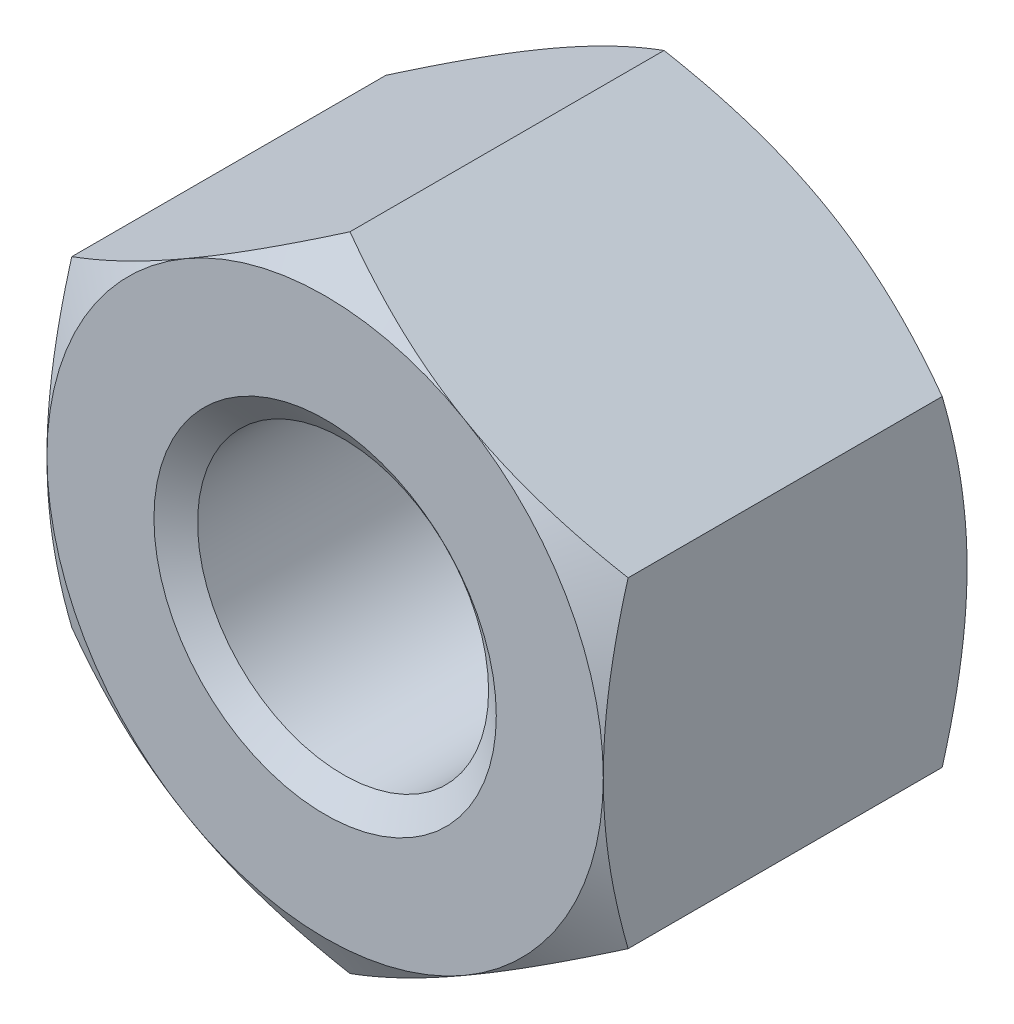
ISO-10303-21;
HEADER;
FILE_DESCRIPTION(('STEP AP214'),'2;1');
FILE_NAME('part.step','',(''),(''),'','','');
FILE_SCHEMA(('AUTOMOTIVE_DESIGN { 1 0 10303 214 1 1 1 1 }'));
ENDSEC;
DATA;
#1=APPLICATION_CONTEXT('core data for automotive mechanical design processes');
#2=APPLICATION_PROTOCOL_DEFINITION('international standard','automotive_design',2000,#1);
#3=PRODUCT_CONTEXT('',#1,'mechanical');
#4=PRODUCT('Part','Part','',(#3));
#5=PRODUCT_RELATED_PRODUCT_CATEGORY('part','',(#4));
#6=PRODUCT_DEFINITION_FORMATION('','',#4);
#7=PRODUCT_DEFINITION_CONTEXT('part definition',#1,'design');
#8=PRODUCT_DEFINITION('design','',#6,#7);
#9=PRODUCT_DEFINITION_SHAPE('','',#8);
#10=(LENGTH_UNIT() NAMED_UNIT(*) SI_UNIT(.MILLI.,.METRE.));
#11=(NAMED_UNIT(*) PLANE_ANGLE_UNIT() SI_UNIT($,.RADIAN.));
#12=(NAMED_UNIT(*) SI_UNIT($,.STERADIAN.) SOLID_ANGLE_UNIT());
#13=UNCERTAINTY_MEASURE_WITH_UNIT(LENGTH_MEASURE(1.E-05),#10,'distance_accuracy_value','');
#14=(GEOMETRIC_REPRESENTATION_CONTEXT(3) GLOBAL_UNCERTAINTY_ASSIGNED_CONTEXT((#13)) GLOBAL_UNIT_ASSIGNED_CONTEXT((#10,
#11,#12)) REPRESENTATION_CONTEXT('',''));
#15=CARTESIAN_POINT('',(0.,0.,0.));
#16=DIRECTION('',(0.,0.,1.));
#17=DIRECTION('',(1.,0.,0.));
#18=AXIS2_PLACEMENT_3D('',#15,#16,#17);
#19=CARTESIAN_POINT('',(0.,0.,-8.5));
#20=DIRECTION('',(0.,0.,1.));
#21=DIRECTION('',(1.,0.,0.));
#22=AXIS2_PLACEMENT_3D('',#19,#20,#21);
#23=CYLINDRICAL_SURFACE('',#22,3.4);
#24=CARTESIAN_POINT('',(0.,0.,-0.420124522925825));
#25=DIRECTION('',(0.,0.,1.));
#26=DIRECTION('',(1.,0.,0.));
#27=AXIS2_PLACEMENT_3D('',#24,#25,#26);
#28=CIRCLE('',#27,3.4);
#29=CARTESIAN_POINT('',(3.4,0.,-0.420124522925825));
#30=VERTEX_POINT('',#29);
#31=EDGE_CURVE('E183',#30,#30,#28,.F.);
#32=ORIENTED_EDGE('',*,*,#31,.F.);
#33=EDGE_LOOP('',(#32));
#34=FACE_BOUND('',#33,.T.);
#35=CARTESIAN_POINT('',(0.,0.,-8.05447547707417));
#36=DIRECTION('',(0.,0.,-1.));
#37=DIRECTION('',(-1.,0.,0.));
#38=AXIS2_PLACEMENT_3D('',#35,#36,#37);
#39=CIRCLE('',#38,3.4);
#40=CARTESIAN_POINT('',(-3.4,0.,-8.05447547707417));
#41=VERTEX_POINT('',#40);
#42=EDGE_CURVE('E48',#41,#41,#39,.F.);
#43=ORIENTED_EDGE('',*,*,#42,.F.);
#44=EDGE_LOOP('',(#43));
#45=FACE_BOUND('',#44,.T.);
#46=ADVANCED_FACE('F43',(#34,#45),#23,.F.);
#47=CARTESIAN_POINT('',(0.,7.50555349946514,-8.5));
#48=DIRECTION('',(-0.500000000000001,0.866025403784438,0.));
#49=DIRECTION('',(-0.866025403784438,-0.500000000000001,0.));
#50=AXIS2_PLACEMENT_3D('',#47,#48,#49);
#51=PLANE('',#50);
#52=DIRECTION('',(0.,0.,1.));
#53=VECTOR('',#52,1.);
#54=CARTESIAN_POINT('',(-6.5,3.75277674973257,-8.5));
#55=LINE('',#54,#53);
#56=CARTESIAN_POINT('',(-6.5,3.75277674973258,-7.91944341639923));
#57=VERTEX_POINT('',#56);
#58=CARTESIAN_POINT('',(-6.5,3.75277674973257,-0.580556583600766));
#59=VERTEX_POINT('',#58);
#60=EDGE_CURVE('E173',#57,#59,#55,.T.);
#61=ORIENTED_EDGE('',*,*,#60,.T.);
#62=CARTESIAN_POINT('',(-6.5002,3.75266127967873,-0.580623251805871));
#63=CARTESIAN_POINT('',(-6.35732254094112,3.8351516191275,-0.533004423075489));
#64=CARTESIAN_POINT('',(-6.21391236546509,3.91794952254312,-0.487546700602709));
#65=CARTESIAN_POINT('',(-5.9259273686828,4.08421773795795,-0.401548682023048));
#66=CARTESIAN_POINT('',(-5.78135207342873,4.16768832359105,-0.361010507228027));
#67=CARTESIAN_POINT('',(-5.34531134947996,4.41943655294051,-0.247571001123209));
#68=CARTESIAN_POINT('',(-5.05212471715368,4.5887079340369,-0.18304780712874));
#69=CARTESIAN_POINT('',(-4.61337625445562,4.84201947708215,-0.107386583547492));
#70=CARTESIAN_POINT('',(-4.46912536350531,4.92530276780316,-0.0858328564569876));
#71=CARTESIAN_POINT('',(-4.17997178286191,5.09224566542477,-0.049690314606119));
#72=CARTESIAN_POINT('',(-4.03506915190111,5.17590523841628,-0.0351008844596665));
#73=CARTESIAN_POINT('',(-3.74501222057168,5.34336968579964,-0.0132587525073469));
#74=CARTESIAN_POINT('',(-3.59985839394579,5.427174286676,-0.00599772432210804));
#75=CARTESIAN_POINT('',(-3.30942466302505,5.59485627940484,0.00103969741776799));
#76=CARTESIAN_POINT('',(-3.16414476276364,5.67873366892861,0.000816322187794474));
#77=CARTESIAN_POINT('',(-2.7661240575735,5.90853103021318,-0.0100834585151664));
#78=CARTESIAN_POINT('',(-2.51351353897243,6.05437578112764,-0.0283818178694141));
#79=CARTESIAN_POINT('',(-2.00997032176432,6.34509659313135,-0.0864063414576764));
#80=CARTESIAN_POINT('',(-1.75903939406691,6.48997163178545,-0.126152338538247));
#81=CARTESIAN_POINT('',(-1.25448277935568,6.78127752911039,-0.225505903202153));
#82=CARTESIAN_POINT('',(-1.00092075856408,6.92767163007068,-0.285534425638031));
#83=CARTESIAN_POINT('',(-0.497578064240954,7.21827667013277,-0.421774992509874));
#84=CARTESIAN_POINT('',(-0.247790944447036,7.36249133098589,-0.497955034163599));
#85=CARTESIAN_POINT('',(0.000200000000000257,7.50566896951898,-0.580623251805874));
#86=B_SPLINE_CURVE_WITH_KNOTS('',3,(#62,#63,#64,#65,#66,#67,#68,#69,#70,#71,#72,#73,#74,#75,#76,
#77,#78,#79,#80,#81,#82,#83,#84,#85),.UNSPECIFIED.,.F.,.F.,(4,2,2,2,2,2,2,2,2,2,2,4),(0.,
0.515105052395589,1.03043143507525,2.06322554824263,2.56697389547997,3.07067772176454,
3.57380860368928,4.07692394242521,4.95279354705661,5.82947446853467,6.72559912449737,
7.61996451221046),.UNSPECIFIED.);
#87=CARTESIAN_POINT('',(-3.25,5.62916512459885,0.));
#88=VERTEX_POINT('',#87);
#89=EDGE_CURVE('E142',#59,#88,#86,.T.);
#90=ORIENTED_EDGE('',*,*,#89,.T.);
#91=CARTESIAN_POINT('',(0.,7.50555349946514,-0.58055658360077));
#92=VERTEX_POINT('',#91);
#93=EDGE_CURVE('E62',#88,#92,#86,.T.);
#94=ORIENTED_EDGE('',*,*,#93,.T.);
#95=DIRECTION('',(0.,0.,1.));
#96=VECTOR('',#95,1.);
#97=CARTESIAN_POINT('',(0.,7.50555349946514,-8.5));
#98=LINE('',#97,#96);
#99=CARTESIAN_POINT('',(0.,7.50555349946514,-7.91944341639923));
#100=VERTEX_POINT('',#99);
#101=EDGE_CURVE('E158',#100,#92,#98,.T.);
#102=ORIENTED_EDGE('',*,*,#101,.F.);
#103=CARTESIAN_POINT('',(-6.5002,3.75266127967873,-7.91937674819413));
#104=CARTESIAN_POINT('',(-6.35732254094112,3.8351516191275,-7.96699557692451));
#105=CARTESIAN_POINT('',(-6.21391236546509,3.91794952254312,-8.01245329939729));
#106=CARTESIAN_POINT('',(-5.92592736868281,4.08421773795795,-8.09845131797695));
#107=CARTESIAN_POINT('',(-5.78135207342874,4.16768832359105,-8.13898949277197));
#108=CARTESIAN_POINT('',(-5.34531134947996,4.41943655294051,-8.25242899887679));
#109=CARTESIAN_POINT('',(-5.05212471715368,4.5887079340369,-8.31695219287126));
#110=CARTESIAN_POINT('',(-4.61337625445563,4.84201947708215,-8.39261341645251));
#111=CARTESIAN_POINT('',(-4.46912536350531,4.92530276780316,-8.41416714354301));
#112=CARTESIAN_POINT('',(-4.17997178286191,5.09224566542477,-8.45030968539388));
#113=CARTESIAN_POINT('',(-4.03506915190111,5.17590523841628,-8.46489911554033));
#114=CARTESIAN_POINT('',(-3.74501222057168,5.34336968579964,-8.48674124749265));
#115=CARTESIAN_POINT('',(-3.59985839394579,5.427174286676,-8.49400227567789));
#116=CARTESIAN_POINT('',(-3.30942466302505,5.59485627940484,-8.50103969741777));
#117=CARTESIAN_POINT('',(-3.16414476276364,5.67873366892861,-8.5008163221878));
#118=CARTESIAN_POINT('',(-2.7661240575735,5.90853103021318,-8.48991654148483));
#119=CARTESIAN_POINT('',(-2.51351353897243,6.05437578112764,-8.47161818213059));
#120=CARTESIAN_POINT('',(-2.00997032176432,6.34509659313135,-8.41359365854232));
#121=CARTESIAN_POINT('',(-1.75903939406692,6.48997163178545,-8.37384766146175));
#122=CARTESIAN_POINT('',(-1.25448277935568,6.78127752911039,-8.27449409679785));
#123=CARTESIAN_POINT('',(-1.00092075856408,6.92767163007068,-8.21446557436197));
#124=CARTESIAN_POINT('',(-0.497578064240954,7.21827667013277,-8.07822500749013));
#125=CARTESIAN_POINT('',(-0.247790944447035,7.36249133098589,-8.0020449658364));
#126=CARTESIAN_POINT('',(0.000200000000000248,7.50566896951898,-7.91937674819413));
#127=B_SPLINE_CURVE_WITH_KNOTS('',3,(#103,#104,#105,#106,#107,#108,#109,#110,#111,#112,#113,
#114,#115,#116,#117,#118,#119,#120,#121,#122,#123,#124,#125,#126),.UNSPECIFIED.,.F.,.F.,(4,2,2,
2,2,2,2,2,2,2,2,4),(0.,0.515105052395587,1.03043143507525,2.06322554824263,2.56697389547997,
3.07067772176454,3.57380860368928,4.07692394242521,4.9527935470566,5.82947446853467,
6.72559912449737,7.61996451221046),.UNSPECIFIED.);
#128=CARTESIAN_POINT('',(-3.25,5.62916512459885,-8.5));
#129=VERTEX_POINT('',#128);
#130=EDGE_CURVE('E176',#129,#100,#127,.T.);
#131=ORIENTED_EDGE('',*,*,#130,.F.);
#132=EDGE_CURVE('E275',#57,#129,#127,.T.);
#133=ORIENTED_EDGE('',*,*,#132,.F.);
#134=EDGE_LOOP('',(#61,#90,#94,#102,#131,#133));
#135=FACE_BOUND('',#134,.T.);
#136=ADVANCED_FACE('F45',(#135),#51,.T.);
#137=CARTESIAN_POINT('',(6.5,3.75277674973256,-8.5));
#138=DIRECTION('',(0.500000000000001,0.866025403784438,0.));
#139=DIRECTION('',(-0.866025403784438,0.500000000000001,0.));
#140=AXIS2_PLACEMENT_3D('',#137,#138,#139);
#141=PLANE('',#140);
#142=ORIENTED_EDGE('',*,*,#101,.T.);
#143=CARTESIAN_POINT('',(-0.000199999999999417,7.50566896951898,-0.580623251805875));
#144=CARTESIAN_POINT('',(0.142677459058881,7.4231786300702,-0.533004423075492));
#145=CARTESIAN_POINT('',(0.286087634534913,7.34038072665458,-0.487546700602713));
#146=CARTESIAN_POINT('',(0.574072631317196,7.17411251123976,-0.401548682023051));
#147=CARTESIAN_POINT('',(0.718647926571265,7.09064192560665,-0.36101050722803));
#148=CARTESIAN_POINT('',(1.15468865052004,6.83889369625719,-0.247571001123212));
#149=CARTESIAN_POINT('',(1.44787528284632,6.66962231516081,-0.183047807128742));
#150=CARTESIAN_POINT('',(1.88662374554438,6.41631077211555,-0.107386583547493));
#151=CARTESIAN_POINT('',(2.03087463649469,6.33302748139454,-0.0858328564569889));
#152=CARTESIAN_POINT('',(2.32002821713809,6.16608458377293,-0.0496903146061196));
#153=CARTESIAN_POINT('',(2.46493084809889,6.08242501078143,-0.0351008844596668));
#154=CARTESIAN_POINT('',(2.75498777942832,5.91496056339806,-0.0132587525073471));
#155=CARTESIAN_POINT('',(2.90014160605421,5.8311559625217,-0.00599772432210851));
#156=CARTESIAN_POINT('',(3.19057533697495,5.66347396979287,0.0010396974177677));
#157=CARTESIAN_POINT('',(3.33585523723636,5.5795965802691,0.000816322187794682));
#158=CARTESIAN_POINT('',(3.7338759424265,5.34979921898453,-0.0100834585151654));
#159=CARTESIAN_POINT('',(3.98648646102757,5.20395446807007,-0.0283818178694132));
#160=CARTESIAN_POINT('',(4.49002967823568,4.91323365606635,-0.0864063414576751));
#161=CARTESIAN_POINT('',(4.74096060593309,4.76835861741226,-0.126152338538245));
#162=CARTESIAN_POINT('',(5.24551722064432,4.47705272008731,-0.225505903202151));
#163=CARTESIAN_POINT('',(5.49907924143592,4.33065861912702,-0.285534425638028));
#164=CARTESIAN_POINT('',(6.00242193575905,4.04005357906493,-0.421774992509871));
#165=CARTESIAN_POINT('',(6.25220905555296,3.89583891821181,-0.497955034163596));
#166=CARTESIAN_POINT('',(6.5002,3.75266127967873,-0.58062325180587));
#167=B_SPLINE_CURVE_WITH_KNOTS('',3,(#143,#144,#145,#146,#147,#148,#149,#150,#151,#152,#153,
#154,#155,#156,#157,#158,#159,#160,#161,#162,#163,#164,#165,#166),.UNSPECIFIED.,.F.,.F.,(4,2,2,
2,2,2,2,2,2,2,2,4),(0.,0.515105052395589,1.03043143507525,2.06322554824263,2.56697389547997,
3.07067772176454,3.57380860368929,4.07692394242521,4.95279354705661,5.82947446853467,
6.72559912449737,7.61996451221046),.UNSPECIFIED.);
#168=CARTESIAN_POINT('',(3.25000000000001,5.62916512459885,0.));
#169=VERTEX_POINT('',#168);
#170=EDGE_CURVE('E152',#92,#169,#167,.T.);
#171=ORIENTED_EDGE('',*,*,#170,.T.);
#172=CARTESIAN_POINT('',(6.5,3.75277674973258,-0.58055658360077));
#173=VERTEX_POINT('',#172);
#174=EDGE_CURVE('E69',#169,#173,#167,.T.);
#175=ORIENTED_EDGE('',*,*,#174,.T.);
#176=DIRECTION('',(0.,0.,1.));
#177=VECTOR('',#176,1.);
#178=CARTESIAN_POINT('',(6.5,3.75277674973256,-8.5));
#179=LINE('',#178,#177);
#180=CARTESIAN_POINT('',(6.5,3.75277674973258,-7.91944341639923));
#181=VERTEX_POINT('',#180);
#182=EDGE_CURVE('E151',#181,#173,#179,.T.);
#183=ORIENTED_EDGE('',*,*,#182,.F.);
#184=CARTESIAN_POINT('',(-0.000199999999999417,7.50566896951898,-7.91937674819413));
#185=CARTESIAN_POINT('',(0.142677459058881,7.4231786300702,-7.96699557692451));
#186=CARTESIAN_POINT('',(0.286087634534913,7.34038072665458,-8.01245329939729));
#187=CARTESIAN_POINT('',(0.574072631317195,7.17411251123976,-8.09845131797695));
#188=CARTESIAN_POINT('',(0.718647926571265,7.09064192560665,-8.13898949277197));
#189=CARTESIAN_POINT('',(1.15468865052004,6.83889369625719,-8.25242899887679));
#190=CARTESIAN_POINT('',(1.44787528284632,6.66962231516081,-8.31695219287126));
#191=CARTESIAN_POINT('',(1.88662374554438,6.41631077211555,-8.39261341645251));
#192=CARTESIAN_POINT('',(2.03087463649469,6.33302748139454,-8.41416714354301));
#193=CARTESIAN_POINT('',(2.32002821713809,6.16608458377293,-8.45030968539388));
#194=CARTESIAN_POINT('',(2.46493084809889,6.08242501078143,-8.46489911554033));
#195=CARTESIAN_POINT('',(2.75498777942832,5.91496056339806,-8.48674124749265));
#196=CARTESIAN_POINT('',(2.90014160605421,5.8311559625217,-8.49400227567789));
#197=CARTESIAN_POINT('',(3.19057533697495,5.66347396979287,-8.50103969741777));
#198=CARTESIAN_POINT('',(3.33585523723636,5.5795965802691,-8.5008163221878));
#199=CARTESIAN_POINT('',(3.7338759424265,5.34979921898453,-8.48991654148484));
#200=CARTESIAN_POINT('',(3.98648646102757,5.20395446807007,-8.47161818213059));
#201=CARTESIAN_POINT('',(4.49002967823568,4.91323365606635,-8.41359365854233));
#202=CARTESIAN_POINT('',(4.74096060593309,4.76835861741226,-8.37384766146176));
#203=CARTESIAN_POINT('',(5.24551722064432,4.47705272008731,-8.27449409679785));
#204=CARTESIAN_POINT('',(5.49907924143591,4.33065861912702,-8.21446557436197));
#205=CARTESIAN_POINT('',(6.00242193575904,4.04005357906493,-8.07822500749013));
#206=CARTESIAN_POINT('',(6.25220905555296,3.89583891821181,-8.00204496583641));
#207=CARTESIAN_POINT('',(6.5002,3.75266127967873,-7.91937674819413));
#208=B_SPLINE_CURVE_WITH_KNOTS('',3,(#184,#185,#186,#187,#188,#189,#190,#191,#192,#193,#194,
#195,#196,#197,#198,#199,#200,#201,#202,#203,#204,#205,#206,#207),.UNSPECIFIED.,.F.,.F.,(4,2,2,
2,2,2,2,2,2,2,2,4),(0.,0.515105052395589,1.03043143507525,2.06322554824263,2.56697389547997,
3.07067772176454,3.57380860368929,4.07692394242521,4.95279354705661,5.82947446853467,
6.72559912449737,7.61996451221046),.UNSPECIFIED.);
#209=CARTESIAN_POINT('',(3.25000000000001,5.62916512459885,-8.5));
#210=VERTEX_POINT('',#209);
#211=EDGE_CURVE('E268',#210,#181,#208,.T.);
#212=ORIENTED_EDGE('',*,*,#211,.F.);
#213=EDGE_CURVE('E274',#100,#210,#208,.T.);
#214=ORIENTED_EDGE('',*,*,#213,.F.);
#215=EDGE_LOOP('',(#142,#171,#175,#183,#212,#214));
#216=FACE_BOUND('',#215,.T.);
#217=ADVANCED_FACE('F149',(#216),#141,.T.);
#218=CARTESIAN_POINT('',(6.5,3.75277674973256,-8.5));
#219=DIRECTION('',(-1.,0.,0.));
#220=DIRECTION('',(0.,0.,1.));
#221=AXIS2_PLACEMENT_3D('',#218,#219,#220);
#222=PLANE('',#221);
#223=CARTESIAN_POINT('',(6.5,-9.95291698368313,-3.11042358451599));
#224=CARTESIAN_POINT('',(6.5,-9.66753022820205,-2.97250893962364));
#225=CARTESIAN_POINT('',(6.5,-9.38146872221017,-2.8359652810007));
#226=CARTESIAN_POINT('',(6.5,-8.80763137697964,-2.56640336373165));
#227=CARTESIAN_POINT('',(6.5,-8.51985525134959,-2.43338571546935));
#228=CARTESIAN_POINT('',(6.5,-7.94066929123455,-2.17095850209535));
#229=CARTESIAN_POINT('',(6.5,-7.64924808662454,-2.04157394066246));
#230=CARTESIAN_POINT('',(6.5,-7.06401043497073,-1.78836220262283));
#231=CARTESIAN_POINT('',(6.5,-6.77019411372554,-1.66453473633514));
#232=CARTESIAN_POINT('',(6.5,-6.17605150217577,-1.42244480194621));
#233=CARTESIAN_POINT('',(6.5,-5.87568957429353,-1.30426931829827));
#234=CARTESIAN_POINT('',(6.5,-5.27142269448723,-1.07717389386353));
#235=CARTESIAN_POINT('',(6.5,-4.96751735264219,-0.968254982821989));
#236=CARTESIAN_POINT('',(6.5,-4.35630541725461,-0.762599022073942));
#237=CARTESIAN_POINT('',(6.5,-4.04900762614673,-0.665836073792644));
#238=CARTESIAN_POINT('',(6.5,-3.43004022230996,-0.487635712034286));
#239=CARTESIAN_POINT('',(6.5,-3.11837202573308,-0.406193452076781));
#240=CARTESIAN_POINT('',(6.5,-2.49046594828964,-0.262584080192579));
#241=CARTESIAN_POINT('',(6.5,-2.17422687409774,-0.200422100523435));
#242=CARTESIAN_POINT('',(6.5,-1.5378916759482,-0.0995742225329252));
#243=CARTESIAN_POINT('',(6.5,-1.2177955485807,-0.0608883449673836));
#244=CARTESIAN_POINT('',(6.5,-0.737141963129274,-0.0229465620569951));
#245=CARTESIAN_POINT('',(6.5,-0.577336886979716,-0.0136452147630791));
#246=CARTESIAN_POINT('',(6.5,-0.25746890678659,-0.00181408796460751));
#247=CARTESIAN_POINT('',(6.5,-0.0974060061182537,0.000715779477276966));
#248=CARTESIAN_POINT('',(6.5,0.222635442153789,-0.00106401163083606));
#249=CARTESIAN_POINT('',(6.5,0.382614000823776,-0.0053717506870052));
#250=CARTESIAN_POINT('',(6.5,0.702250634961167,-0.020717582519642));
#251=CARTESIAN_POINT('',(6.5,0.861908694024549,-0.0317560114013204));
#252=CARTESIAN_POINT('',(6.5,1.24887053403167,-0.0664368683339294));
#253=CARTESIAN_POINT('',(6.5,1.47587694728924,-0.0934518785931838));
#254=CARTESIAN_POINT('',(6.5,1.92815030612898,-0.159589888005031));
#255=CARTESIAN_POINT('',(6.5,2.15341675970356,-0.198716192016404));
#256=CARTESIAN_POINT('',(6.5,2.60202427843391,-0.2876891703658));
#257=CARTESIAN_POINT('',(6.5,2.82536331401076,-0.337545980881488));
#258=CARTESIAN_POINT('',(6.5,3.26974354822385,-0.446458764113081));
#259=CARTESIAN_POINT('',(6.5,3.49078496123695,-0.505513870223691));
#260=CARTESIAN_POINT('',(6.5,3.93601414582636,-0.632954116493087));
#261=CARTESIAN_POINT('',(6.5,4.16014622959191,-0.701532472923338));
#262=CARTESIAN_POINT('',(6.5,4.60604131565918,-0.8454651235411));
#263=CARTESIAN_POINT('',(6.5,4.82780583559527,-0.920814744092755));
#264=CARTESIAN_POINT('',(6.5,5.26807593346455,-1.07673350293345));
#265=CARTESIAN_POINT('',(6.5,5.48659282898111,-1.15727087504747));
#266=CARTESIAN_POINT('',(6.5,5.9219312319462,-1.32307270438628));
#267=CARTESIAN_POINT('',(6.5,6.13875201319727,-1.40833907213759));
#268=CARTESIAN_POINT('',(6.5,6.35478510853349,-1.49550213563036));
#269=B_SPLINE_CURVE_WITH_KNOTS('',3,(#223,#224,#225,#226,#227,#228,#229,#230,#231,#232,#233,
#234,#235,#236,#237,#238,#239,#240,#241,#242,#243,#244,#245,#246,#247,#248,#249,#250,#251,#252,
#253,#254,#255,#256,#257,#258,#259,#260,#261,#262,#263,#264,#265,#266,#267,#268),.UNSPECIFIED.,
.F.,.F.,(4,2,2,2,2,2,2,2,2,2,2,2,2,2,2,2,2,2,2,2,2,2,4),(0.,0.95090416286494,1.90197187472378,
2.85848216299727,3.81494253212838,4.78314526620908,5.75145556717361,6.71766655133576,
7.68357137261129,8.64973308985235,9.61589566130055,10.0960003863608,10.5760988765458,
11.0560626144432,11.5360503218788,12.2214931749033,12.9071232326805,13.5934038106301,
14.2796197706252,14.9826563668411,15.6852113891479,16.3838119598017,17.082696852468),.UNSPECIFIED.);
#270=CARTESIAN_POINT('',(6.5,-3.75277674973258,-0.58055658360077));
#271=VERTEX_POINT('',#270);
#272=CARTESIAN_POINT('',(6.5,0.,0.));
#273=VERTEX_POINT('',#272);
#274=EDGE_CURVE('E144',#271,#273,#269,.T.);
#275=ORIENTED_EDGE('',*,*,#274,.F.);
#276=DIRECTION('',(0.,0.,1.));
#277=VECTOR('',#276,1.);
#278=CARTESIAN_POINT('',(6.5,-3.75277674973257,-8.5));
#279=LINE('',#278,#277);
#280=CARTESIAN_POINT('',(6.5,-3.75277674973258,-7.91944341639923));
#281=VERTEX_POINT('',#280);
#282=EDGE_CURVE('E159',#281,#271,#279,.T.);
#283=ORIENTED_EDGE('',*,*,#282,.F.);
#284=CARTESIAN_POINT('',(6.5,-9.95291698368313,-5.38957641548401));
#285=CARTESIAN_POINT('',(6.5,-9.66753022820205,-5.52749106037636));
#286=CARTESIAN_POINT('',(6.5,-9.38146872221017,-5.6640347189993));
#287=CARTESIAN_POINT('',(6.5,-8.80763137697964,-5.93359663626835));
#288=CARTESIAN_POINT('',(6.5,-8.51985525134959,-6.06661428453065));
#289=CARTESIAN_POINT('',(6.5,-7.94066929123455,-6.32904149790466));
#290=CARTESIAN_POINT('',(6.5,-7.64924808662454,-6.45842605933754));
#291=CARTESIAN_POINT('',(6.5,-7.06401043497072,-6.71163779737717));
#292=CARTESIAN_POINT('',(6.5,-6.77019411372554,-6.83546526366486));
#293=CARTESIAN_POINT('',(6.5,-6.17605150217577,-7.07755519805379));
#294=CARTESIAN_POINT('',(6.5,-5.87568957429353,-7.19573068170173));
#295=CARTESIAN_POINT('',(6.5,-5.27142269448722,-7.42282610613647));
#296=CARTESIAN_POINT('',(6.5,-4.96751735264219,-7.53174501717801));
#297=CARTESIAN_POINT('',(6.5,-4.35630541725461,-7.73740097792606));
#298=CARTESIAN_POINT('',(6.5,-4.04900762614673,-7.83416392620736));
#299=CARTESIAN_POINT('',(6.5,-3.43004022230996,-8.01236428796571));
#300=CARTESIAN_POINT('',(6.5,-3.11837202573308,-8.09380654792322));
#301=CARTESIAN_POINT('',(6.5,-2.49046594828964,-8.23741591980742));
#302=CARTESIAN_POINT('',(6.5,-2.17422687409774,-8.29957789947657));
#303=CARTESIAN_POINT('',(6.5,-1.5378916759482,-8.40042577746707));
#304=CARTESIAN_POINT('',(6.5,-1.21779554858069,-8.43911165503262));
#305=CARTESIAN_POINT('',(6.5,-0.737141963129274,-8.477053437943));
#306=CARTESIAN_POINT('',(6.5,-0.577336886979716,-8.48635478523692));
#307=CARTESIAN_POINT('',(6.5,-0.257468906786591,-8.49818591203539));
#308=CARTESIAN_POINT('',(6.5,-0.0974060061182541,-8.50071577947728));
#309=CARTESIAN_POINT('',(6.5,0.222635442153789,-8.49893598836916));
#310=CARTESIAN_POINT('',(6.5,0.382614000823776,-8.494628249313));
#311=CARTESIAN_POINT('',(6.5,0.702250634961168,-8.47928241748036));
#312=CARTESIAN_POINT('',(6.5,0.861908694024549,-8.46824398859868));
#313=CARTESIAN_POINT('',(6.5,1.24887053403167,-8.43356313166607));
#314=CARTESIAN_POINT('',(6.5,1.47587694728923,-8.40654812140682));
#315=CARTESIAN_POINT('',(6.5,1.92815030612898,-8.34041011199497));
#316=CARTESIAN_POINT('',(6.5,2.15341675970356,-8.3012838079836));
#317=CARTESIAN_POINT('',(6.5,2.6020242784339,-8.2123108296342));
#318=CARTESIAN_POINT('',(6.5,2.82536331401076,-8.16245401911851));
#319=CARTESIAN_POINT('',(6.5,3.26974354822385,-8.05354123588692));
#320=CARTESIAN_POINT('',(6.5,3.49078496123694,-7.99448612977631));
#321=CARTESIAN_POINT('',(6.5,3.93601414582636,-7.86704588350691));
#322=CARTESIAN_POINT('',(6.5,4.16014622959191,-7.79846752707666));
#323=CARTESIAN_POINT('',(6.5,4.60604131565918,-7.6545348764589));
#324=CARTESIAN_POINT('',(6.5,4.82780583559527,-7.57918525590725));
#325=CARTESIAN_POINT('',(6.5,5.26807593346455,-7.42326649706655));
#326=CARTESIAN_POINT('',(6.5,5.48659282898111,-7.34272912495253));
#327=CARTESIAN_POINT('',(6.5,5.9219312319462,-7.17692729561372));
#328=CARTESIAN_POINT('',(6.5,6.13875201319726,-7.09166092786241));
#329=CARTESIAN_POINT('',(6.5,6.35478510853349,-7.00449786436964));
#330=B_SPLINE_CURVE_WITH_KNOTS('',3,(#284,#285,#286,#287,#288,#289,#290,#291,#292,#293,#294,
#295,#296,#297,#298,#299,#300,#301,#302,#303,#304,#305,#306,#307,#308,#309,#310,#311,#312,#313,
#314,#315,#316,#317,#318,#319,#320,#321,#322,#323,#324,#325,#326,#327,#328,#329),.UNSPECIFIED.,
.F.,.F.,(4,2,2,2,2,2,2,2,2,2,2,2,2,2,2,2,2,2,2,2,2,2,4),(0.,0.95090416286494,1.90197187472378,
2.85848216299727,3.81494253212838,4.78314526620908,5.75145556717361,6.71766655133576,
7.68357137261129,8.64973308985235,9.61589566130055,10.0960003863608,10.5760988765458,
11.0560626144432,11.5360503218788,12.2214931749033,12.9071232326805,13.5934038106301,
14.2796197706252,14.9826563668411,15.6852113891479,16.3838119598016,17.082696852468),.UNSPECIFIED.);
#331=CARTESIAN_POINT('',(6.5,0.,-8.5));
#332=VERTEX_POINT('',#331);
#333=EDGE_CURVE('E282',#281,#332,#330,.T.);
#334=ORIENTED_EDGE('',*,*,#333,.T.);
#335=EDGE_CURVE('E157',#332,#181,#330,.T.);
#336=ORIENTED_EDGE('',*,*,#335,.T.);
#337=ORIENTED_EDGE('',*,*,#182,.T.);
#338=EDGE_CURVE('E134',#273,#173,#269,.T.);
#339=ORIENTED_EDGE('',*,*,#338,.F.);
#340=EDGE_LOOP('',(#275,#283,#334,#336,#337,#339));
#341=FACE_BOUND('',#340,.T.);
#342=ADVANCED_FACE('F155',(#341),#222,.F.);
#343=CARTESIAN_POINT('',(0.,-7.50555349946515,-8.5));
#344=DIRECTION('',(0.5,-0.866025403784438,0.));
#345=DIRECTION('',(0.866025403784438,0.5,0.));
#346=AXIS2_PLACEMENT_3D('',#343,#344,#345);
#347=PLANE('',#346);
#348=ORIENTED_EDGE('',*,*,#282,.T.);
#349=CARTESIAN_POINT('',(6.5002,-3.75266127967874,-0.580623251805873));
#350=CARTESIAN_POINT('',(6.35732254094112,-3.83515161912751,-0.533004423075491));
#351=CARTESIAN_POINT('',(6.21391236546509,-3.91794952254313,-0.487546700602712));
#352=CARTESIAN_POINT('',(5.9259273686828,-4.08421773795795,-0.401548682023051));
#353=CARTESIAN_POINT('',(5.78135207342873,-4.16768832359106,-0.36101050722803));
#354=CARTESIAN_POINT('',(5.34531134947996,-4.41943655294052,-0.247571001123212));
#355=CARTESIAN_POINT('',(5.05212471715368,-4.58870793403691,-0.183047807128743));
#356=CARTESIAN_POINT('',(4.61337625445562,-4.84201947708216,-0.107386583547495));
#357=CARTESIAN_POINT('',(4.46912536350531,-4.92530276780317,-0.0858328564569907));
#358=CARTESIAN_POINT('',(4.17997178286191,-5.09224566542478,-0.0496903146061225));
#359=CARTESIAN_POINT('',(4.03506915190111,-5.17590523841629,-0.0351008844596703));
#360=CARTESIAN_POINT('',(3.74501222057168,-5.34336968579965,-0.0132587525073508));
#361=CARTESIAN_POINT('',(3.59985839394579,-5.42717428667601,-0.00599772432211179));
#362=CARTESIAN_POINT('',(3.30942466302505,-5.59485627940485,0.00103969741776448));
#363=CARTESIAN_POINT('',(3.16414476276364,-5.67873366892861,0.000816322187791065));
#364=CARTESIAN_POINT('',(2.7661240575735,-5.90853103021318,-0.0100834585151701));
#365=CARTESIAN_POINT('',(2.51351353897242,-6.05437578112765,-0.0283818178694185));
#366=CARTESIAN_POINT('',(2.00997032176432,-6.34509659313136,-0.0864063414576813));
#367=CARTESIAN_POINT('',(1.75903939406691,-6.48997163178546,-0.126152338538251));
#368=CARTESIAN_POINT('',(1.25448277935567,-6.7812775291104,-0.225505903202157));
#369=CARTESIAN_POINT('',(1.00092075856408,-6.92767163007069,-0.285534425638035));
#370=CARTESIAN_POINT('',(0.497578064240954,-7.21827667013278,-0.421774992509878));
#371=CARTESIAN_POINT('',(0.247790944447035,-7.3624913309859,-0.497955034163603));
#372=CARTESIAN_POINT('',(-0.000200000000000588,-7.50566896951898,-0.580623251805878));
#373=B_SPLINE_CURVE_WITH_KNOTS('',3,(#349,#350,#351,#352,#353,#354,#355,#356,#357,#358,#359,
#360,#361,#362,#363,#364,#365,#366,#367,#368,#369,#370,#371,#372),.UNSPECIFIED.,.F.,.F.,(4,2,2,
2,2,2,2,2,2,2,2,4),(0.,0.515105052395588,1.03043143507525,2.06322554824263,2.56697389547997,
3.07067772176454,3.57380860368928,4.07692394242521,4.95279354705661,5.82947446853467,
6.72559912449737,7.61996451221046),.UNSPECIFIED.);
#374=CARTESIAN_POINT('',(3.25,-5.62916512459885,0.));
#375=VERTEX_POINT('',#374);
#376=EDGE_CURVE('E380',#271,#375,#373,.T.);
#377=ORIENTED_EDGE('',*,*,#376,.T.);
#378=CARTESIAN_POINT('',(0.,-7.50555349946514,-0.58055658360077));
#379=VERTEX_POINT('',#378);
#380=EDGE_CURVE('E236',#375,#379,#373,.T.);
#381=ORIENTED_EDGE('',*,*,#380,.T.);
#382=DIRECTION('',(0.,0.,1.));
#383=VECTOR('',#382,1.);
#384=CARTESIAN_POINT('',(0.,-7.50555349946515,-8.5));
#385=LINE('',#384,#383);
#386=CARTESIAN_POINT('',(0.,-7.50555349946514,-7.91944341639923));
#387=VERTEX_POINT('',#386);
#388=EDGE_CURVE('E164',#387,#379,#385,.T.);
#389=ORIENTED_EDGE('',*,*,#388,.F.);
#390=CARTESIAN_POINT('',(6.5002,-3.75266127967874,-7.91937674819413));
#391=CARTESIAN_POINT('',(6.35732254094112,-3.83515161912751,-7.96699557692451));
#392=CARTESIAN_POINT('',(6.21391236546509,-3.91794952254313,-8.01245329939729));
#393=CARTESIAN_POINT('',(5.9259273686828,-4.08421773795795,-8.09845131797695));
#394=CARTESIAN_POINT('',(5.78135207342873,-4.16768832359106,-8.13898949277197));
#395=CARTESIAN_POINT('',(5.34531134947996,-4.41943655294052,-8.25242899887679));
#396=CARTESIAN_POINT('',(5.05212471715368,-4.58870793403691,-8.31695219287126));
#397=CARTESIAN_POINT('',(4.61337625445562,-4.84201947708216,-8.39261341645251));
#398=CARTESIAN_POINT('',(4.46912536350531,-4.92530276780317,-8.41416714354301));
#399=CARTESIAN_POINT('',(4.17997178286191,-5.09224566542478,-8.45030968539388));
#400=CARTESIAN_POINT('',(4.03506915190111,-5.17590523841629,-8.46489911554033));
#401=CARTESIAN_POINT('',(3.74501222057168,-5.34336968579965,-8.48674124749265));
#402=CARTESIAN_POINT('',(3.59985839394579,-5.42717428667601,-8.49400227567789));
#403=CARTESIAN_POINT('',(3.30942466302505,-5.59485627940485,-8.50103969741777));
#404=CARTESIAN_POINT('',(3.16414476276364,-5.67873366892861,-8.50081632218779));
#405=CARTESIAN_POINT('',(2.7661240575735,-5.90853103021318,-8.48991654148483));
#406=CARTESIAN_POINT('',(2.51351353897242,-6.05437578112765,-8.47161818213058));
#407=CARTESIAN_POINT('',(2.00997032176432,-6.34509659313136,-8.41359365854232));
#408=CARTESIAN_POINT('',(1.75903939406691,-6.48997163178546,-8.37384766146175));
#409=CARTESIAN_POINT('',(1.25448277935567,-6.7812775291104,-8.27449409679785));
#410=CARTESIAN_POINT('',(1.00092075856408,-6.92767163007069,-8.21446557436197));
#411=CARTESIAN_POINT('',(0.497578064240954,-7.21827667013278,-8.07822500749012));
#412=CARTESIAN_POINT('',(0.247790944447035,-7.3624913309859,-8.0020449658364));
#413=CARTESIAN_POINT('',(-0.000200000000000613,-7.50566896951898,-7.91937674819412));
#414=B_SPLINE_CURVE_WITH_KNOTS('',3,(#390,#391,#392,#393,#394,#395,#396,#397,#398,#399,#400,
#401,#402,#403,#404,#405,#406,#407,#408,#409,#410,#411,#412,#413),.UNSPECIFIED.,.F.,.F.,(4,2,2,
2,2,2,2,2,2,2,2,4),(0.,0.515105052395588,1.03043143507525,2.06322554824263,2.56697389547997,
3.07067772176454,3.57380860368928,4.07692394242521,4.95279354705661,5.82947446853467,
6.72559912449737,7.61996451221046),.UNSPECIFIED.);
#415=CARTESIAN_POINT('',(3.25,-5.62916512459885,-8.5));
#416=VERTEX_POINT('',#415);
#417=EDGE_CURVE('E289',#416,#387,#414,.T.);
#418=ORIENTED_EDGE('',*,*,#417,.F.);
#419=EDGE_CURVE('E288',#281,#416,#414,.T.);
#420=ORIENTED_EDGE('',*,*,#419,.F.);
#421=EDGE_LOOP('',(#348,#377,#381,#389,#418,#420));
#422=FACE_BOUND('',#421,.T.);
#423=ADVANCED_FACE('F301',(#422),#347,.T.);
#424=CARTESIAN_POINT('',(-6.5,-3.75277674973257,-8.5));
#425=DIRECTION('',(-0.500000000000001,-0.866025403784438,0.));
#426=DIRECTION('',(0.866025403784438,-0.500000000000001,0.));
#427=AXIS2_PLACEMENT_3D('',#424,#425,#426);
#428=PLANE('',#427);
#429=ORIENTED_EDGE('',*,*,#388,.T.);
#430=CARTESIAN_POINT('',(0.000199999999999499,-7.50566896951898,-0.580623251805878));
#431=CARTESIAN_POINT('',(-0.142677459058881,-7.42317863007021,-0.533004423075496));
#432=CARTESIAN_POINT('',(-0.286087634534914,-7.34038072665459,-0.487546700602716));
#433=CARTESIAN_POINT('',(-0.574072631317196,-7.17411251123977,-0.401548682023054));
#434=CARTESIAN_POINT('',(-0.718647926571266,-7.09064192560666,-0.361010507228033));
#435=CARTESIAN_POINT('',(-1.15468865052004,-6.8388936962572,-0.247571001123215));
#436=CARTESIAN_POINT('',(-1.44787528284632,-6.66962231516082,-0.183047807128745));
#437=CARTESIAN_POINT('',(-1.88662374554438,-6.41631077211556,-0.107386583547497));
#438=CARTESIAN_POINT('',(-2.0308746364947,-6.33302748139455,-0.0858328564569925));
#439=CARTESIAN_POINT('',(-2.32002821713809,-6.16608458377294,-0.0496903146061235));
#440=CARTESIAN_POINT('',(-2.46493084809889,-6.08242501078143,-0.0351008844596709));
#441=CARTESIAN_POINT('',(-2.75498777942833,-5.91496056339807,-0.0132587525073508));
#442=CARTESIAN_POINT('',(-2.90014160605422,-5.83115596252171,-0.00599772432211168));
#443=CARTESIAN_POINT('',(-3.19057533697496,-5.66347396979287,0.00103969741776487));
#444=CARTESIAN_POINT('',(-3.33585523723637,-5.5795965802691,0.000816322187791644));
#445=CARTESIAN_POINT('',(-3.7338759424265,-5.34979921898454,-0.010083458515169));
#446=CARTESIAN_POINT('',(-3.98648646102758,-5.20395446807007,-0.0283818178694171));
#447=CARTESIAN_POINT('',(-4.49002967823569,-4.91323365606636,-0.0864063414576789));
#448=CARTESIAN_POINT('',(-4.74096060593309,-4.76835861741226,-0.126152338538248));
#449=CARTESIAN_POINT('',(-5.24551722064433,-4.47705272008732,-0.225505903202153));
#450=CARTESIAN_POINT('',(-5.49907924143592,-4.33065861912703,-0.285534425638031));
#451=CARTESIAN_POINT('',(-6.00242193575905,-4.04005357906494,-0.421774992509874));
#452=CARTESIAN_POINT('',(-6.25220905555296,-3.89583891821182,-0.497955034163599));
#453=CARTESIAN_POINT('',(-6.5002,-3.75266127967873,-0.580623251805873));
#454=B_SPLINE_CURVE_WITH_KNOTS('',3,(#430,#431,#432,#433,#434,#435,#436,#437,#438,#439,#440,
#441,#442,#443,#444,#445,#446,#447,#448,#449,#450,#451,#452,#453),.UNSPECIFIED.,.F.,.F.,(4,2,2,
2,2,2,2,2,2,2,2,4),(0.,0.515105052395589,1.03043143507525,2.06322554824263,2.56697389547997,
3.07067772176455,3.57380860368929,4.07692394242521,4.95279354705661,5.82947446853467,
6.72559912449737,7.61996451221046),.UNSPECIFIED.);
#455=CARTESIAN_POINT('',(-3.25,-5.62916512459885,0.));
#456=VERTEX_POINT('',#455);
#457=EDGE_CURVE('E377',#379,#456,#454,.T.);
#458=ORIENTED_EDGE('',*,*,#457,.T.);
#459=CARTESIAN_POINT('',(-6.5,-3.75277674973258,-0.58055658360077));
#460=VERTEX_POINT('',#459);
#461=EDGE_CURVE('E209',#456,#460,#454,.T.);
#462=ORIENTED_EDGE('',*,*,#461,.T.);
#463=DIRECTION('',(0.,0.,1.));
#464=VECTOR('',#463,1.);
#465=CARTESIAN_POINT('',(-6.5,-3.75277674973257,-8.5));
#466=LINE('',#465,#464);
#467=CARTESIAN_POINT('',(-6.5,-3.75277674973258,-7.91944341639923));
#468=VERTEX_POINT('',#467);
#469=EDGE_CURVE('E170',#468,#460,#466,.T.);
#470=ORIENTED_EDGE('',*,*,#469,.F.);
#471=CARTESIAN_POINT('',(0.000199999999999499,-7.50566896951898,-7.91937674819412));
#472=CARTESIAN_POINT('',(-0.142677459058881,-7.42317863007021,-7.9669955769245));
#473=CARTESIAN_POINT('',(-0.286087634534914,-7.34038072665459,-8.01245329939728));
#474=CARTESIAN_POINT('',(-0.574072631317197,-7.17411251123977,-8.09845131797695));
#475=CARTESIAN_POINT('',(-0.718647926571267,-7.09064192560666,-8.13898949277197));
#476=CARTESIAN_POINT('',(-1.15468865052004,-6.8388936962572,-8.25242899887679));
#477=CARTESIAN_POINT('',(-1.44787528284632,-6.66962231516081,-8.31695219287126));
#478=CARTESIAN_POINT('',(-1.88662374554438,-6.41631077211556,-8.39261341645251));
#479=CARTESIAN_POINT('',(-2.0308746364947,-6.33302748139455,-8.41416714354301));
#480=CARTESIAN_POINT('',(-2.3200282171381,-6.16608458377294,-8.45030968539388));
#481=CARTESIAN_POINT('',(-2.4649308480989,-6.08242501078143,-8.46489911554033));
#482=CARTESIAN_POINT('',(-2.75498777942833,-5.91496056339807,-8.48674124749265));
#483=CARTESIAN_POINT('',(-2.90014160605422,-5.83115596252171,-8.49400227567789));
#484=CARTESIAN_POINT('',(-3.19057533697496,-5.66347396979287,-8.50103969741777));
#485=CARTESIAN_POINT('',(-3.33585523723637,-5.5795965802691,-8.50081632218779));
#486=CARTESIAN_POINT('',(-3.7338759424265,-5.34979921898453,-8.48991654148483));
#487=CARTESIAN_POINT('',(-3.98648646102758,-5.20395446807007,-8.47161818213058));
#488=CARTESIAN_POINT('',(-4.49002967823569,-4.91323365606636,-8.41359365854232));
#489=CARTESIAN_POINT('',(-4.74096060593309,-4.76835861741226,-8.37384766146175));
#490=CARTESIAN_POINT('',(-5.24551722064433,-4.47705272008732,-8.27449409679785));
#491=CARTESIAN_POINT('',(-5.49907924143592,-4.33065861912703,-8.21446557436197));
#492=CARTESIAN_POINT('',(-6.00242193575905,-4.04005357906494,-8.07822500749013));
#493=CARTESIAN_POINT('',(-6.25220905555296,-3.89583891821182,-8.0020449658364));
#494=CARTESIAN_POINT('',(-6.5002,-3.75266127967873,-7.91937674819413));
#495=B_SPLINE_CURVE_WITH_KNOTS('',3,(#471,#472,#473,#474,#475,#476,#477,#478,#479,#480,#481,
#482,#483,#484,#485,#486,#487,#488,#489,#490,#491,#492,#493,#494),.UNSPECIFIED.,.F.,.F.,(4,2,2,
2,2,2,2,2,2,2,2,4),(0.,0.51510505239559,1.03043143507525,2.06322554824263,2.56697389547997,
3.07067772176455,3.57380860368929,4.07692394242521,4.95279354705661,5.82947446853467,
6.72559912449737,7.61996451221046),.UNSPECIFIED.);
#496=CARTESIAN_POINT('',(-3.25,-5.62916512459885,-8.5));
#497=VERTEX_POINT('',#496);
#498=EDGE_CURVE('E296',#497,#468,#495,.T.);
#499=ORIENTED_EDGE('',*,*,#498,.F.);
#500=EDGE_CURVE('E295',#387,#497,#495,.T.);
#501=ORIENTED_EDGE('',*,*,#500,.F.);
#502=EDGE_LOOP('',(#429,#458,#462,#470,#499,#501));
#503=FACE_BOUND('',#502,.T.);
#504=ADVANCED_FACE('F304',(#503),#428,.T.);
#505=CARTESIAN_POINT('',(-6.5,3.75277674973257,-8.5));
#506=DIRECTION('',(-1.,0.,0.));
#507=DIRECTION('',(0.,0.,1.));
#508=AXIS2_PLACEMENT_3D('',#505,#506,#507);
#509=PLANE('',#508);
#510=ORIENTED_EDGE('',*,*,#469,.T.);
#511=CARTESIAN_POINT('',(-6.5,-9.95291698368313,-3.11042358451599));
#512=CARTESIAN_POINT('',(-6.5,-9.66753022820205,-2.97250893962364));
#513=CARTESIAN_POINT('',(-6.5,-9.38146872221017,-2.8359652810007));
#514=CARTESIAN_POINT('',(-6.5,-8.80763137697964,-2.56640336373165));
#515=CARTESIAN_POINT('',(-6.5,-8.51985525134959,-2.43338571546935));
#516=CARTESIAN_POINT('',(-6.5,-7.94066929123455,-2.17095850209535));
#517=CARTESIAN_POINT('',(-6.5,-7.64924808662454,-2.04157394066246));
#518=CARTESIAN_POINT('',(-6.5,-7.06401043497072,-1.78836220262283));
#519=CARTESIAN_POINT('',(-6.5,-6.77019411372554,-1.66453473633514));
#520=CARTESIAN_POINT('',(-6.5,-6.17605150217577,-1.42244480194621));
#521=CARTESIAN_POINT('',(-6.5,-5.87568957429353,-1.30426931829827));
#522=CARTESIAN_POINT('',(-6.5,-5.27142269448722,-1.07717389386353));
#523=CARTESIAN_POINT('',(-6.5,-4.96751735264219,-0.968254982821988));
#524=CARTESIAN_POINT('',(-6.5,-4.35630541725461,-0.762599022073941));
#525=CARTESIAN_POINT('',(-6.5,-4.04900762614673,-0.665836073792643));
#526=CARTESIAN_POINT('',(-6.5,-3.43004022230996,-0.487635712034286));
#527=CARTESIAN_POINT('',(-6.5,-3.11837202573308,-0.40619345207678));
#528=CARTESIAN_POINT('',(-6.5,-2.49046594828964,-0.262584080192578));
#529=CARTESIAN_POINT('',(-6.5,-2.17422687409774,-0.200422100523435));
#530=CARTESIAN_POINT('',(-6.5,-1.5378916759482,-0.0995742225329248));
#531=CARTESIAN_POINT('',(-6.5,-1.21779554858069,-0.0608883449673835));
#532=CARTESIAN_POINT('',(-6.5,-0.737141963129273,-0.0229465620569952));
#533=CARTESIAN_POINT('',(-6.5,-0.577336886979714,-0.0136452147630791));
#534=CARTESIAN_POINT('',(-6.5,-0.257468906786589,-0.00181408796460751));
#535=CARTESIAN_POINT('',(-6.5,-0.0974060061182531,0.000715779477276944));
#536=CARTESIAN_POINT('',(-6.5,0.22263544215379,-0.00106401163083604));
#537=CARTESIAN_POINT('',(-6.5,0.382614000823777,-0.00537175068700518));
#538=CARTESIAN_POINT('',(-6.5,0.702250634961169,-0.020717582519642));
#539=CARTESIAN_POINT('',(-6.5,0.861908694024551,-0.0317560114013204));
#540=CARTESIAN_POINT('',(-6.5,1.24887053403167,-0.0664368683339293));
#541=CARTESIAN_POINT('',(-6.5,1.47587694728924,-0.0934518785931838));
#542=CARTESIAN_POINT('',(-6.5,1.92815030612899,-0.159589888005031));
#543=CARTESIAN_POINT('',(-6.5,2.15341675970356,-0.198716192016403));
#544=CARTESIAN_POINT('',(-6.5,2.60202427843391,-0.2876891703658));
#545=CARTESIAN_POINT('',(-6.5,2.82536331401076,-0.337545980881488));
#546=CARTESIAN_POINT('',(-6.5,3.26974354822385,-0.446458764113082));
#547=CARTESIAN_POINT('',(-6.5,3.49078496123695,-0.505513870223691));
#548=CARTESIAN_POINT('',(-6.5,3.93601414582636,-0.632954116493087));
#549=CARTESIAN_POINT('',(-6.5,4.16014622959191,-0.701532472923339));
#550=CARTESIAN_POINT('',(-6.5,4.60604131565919,-0.845465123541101));
#551=CARTESIAN_POINT('',(-6.5,4.82780583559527,-0.920814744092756));
#552=CARTESIAN_POINT('',(-6.5,5.26807593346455,-1.07673350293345));
#553=CARTESIAN_POINT('',(-6.5,5.48659282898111,-1.15727087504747));
#554=CARTESIAN_POINT('',(-6.5,5.9219312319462,-1.32307270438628));
#555=CARTESIAN_POINT('',(-6.5,6.13875201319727,-1.40833907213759));
#556=CARTESIAN_POINT('',(-6.5,6.35478510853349,-1.49550213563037));
#557=B_SPLINE_CURVE_WITH_KNOTS('',3,(#511,#512,#513,#514,#515,#516,#517,#518,#519,#520,#521,
#522,#523,#524,#525,#526,#527,#528,#529,#530,#531,#532,#533,#534,#535,#536,#537,#538,#539,#540,
#541,#542,#543,#544,#545,#546,#547,#548,#549,#550,#551,#552,#553,#554,#555,#556),.UNSPECIFIED.,
.F.,.F.,(4,2,2,2,2,2,2,2,2,2,2,2,2,2,2,2,2,2,2,2,2,2,4),(0.,0.95090416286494,1.90197187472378,
2.85848216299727,3.81494253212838,4.78314526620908,5.75145556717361,6.71766655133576,
7.68357137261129,8.64973308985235,9.61589566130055,10.0960003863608,10.5760988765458,
11.0560626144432,11.5360503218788,12.2214931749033,12.9071232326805,13.5934038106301,
14.2796197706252,14.9826563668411,15.6852113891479,16.3838119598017,17.082696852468),.UNSPECIFIED.);
#558=CARTESIAN_POINT('',(-6.5,0.,0.));
#559=VERTEX_POINT('',#558);
#560=EDGE_CURVE('E208',#460,#559,#557,.T.);
#561=ORIENTED_EDGE('',*,*,#560,.T.);
#562=EDGE_CURVE('E200',#559,#59,#557,.T.);
#563=ORIENTED_EDGE('',*,*,#562,.T.);
#564=ORIENTED_EDGE('',*,*,#60,.F.);
#565=CARTESIAN_POINT('',(-6.5,-9.95291698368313,-5.38957641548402));
#566=CARTESIAN_POINT('',(-6.5,-9.66753022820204,-5.52749106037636));
#567=CARTESIAN_POINT('',(-6.5,-9.38146872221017,-5.66403471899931));
#568=CARTESIAN_POINT('',(-6.5,-8.80763137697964,-5.93359663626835));
#569=CARTESIAN_POINT('',(-6.5,-8.51985525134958,-6.06661428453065));
#570=CARTESIAN_POINT('',(-6.5,-7.94066929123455,-6.32904149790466));
#571=CARTESIAN_POINT('',(-6.5,-7.64924808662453,-6.45842605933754));
#572=CARTESIAN_POINT('',(-6.5,-7.06401043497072,-6.71163779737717));
#573=CARTESIAN_POINT('',(-6.5,-6.77019411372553,-6.83546526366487));
#574=CARTESIAN_POINT('',(-6.5,-6.17605150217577,-7.07755519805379));
#575=CARTESIAN_POINT('',(-6.5,-5.87568957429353,-7.19573068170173));
#576=CARTESIAN_POINT('',(-6.5,-5.27142269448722,-7.42282610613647));
#577=CARTESIAN_POINT('',(-6.5,-4.96751735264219,-7.53174501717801));
#578=CARTESIAN_POINT('',(-6.5,-4.3563054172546,-7.73740097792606));
#579=CARTESIAN_POINT('',(-6.5,-4.04900762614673,-7.83416392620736));
#580=CARTESIAN_POINT('',(-6.5,-3.43004022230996,-8.01236428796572));
#581=CARTESIAN_POINT('',(-6.5,-3.11837202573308,-8.09380654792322));
#582=CARTESIAN_POINT('',(-6.5,-2.49046594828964,-8.23741591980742));
#583=CARTESIAN_POINT('',(-6.5,-2.17422687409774,-8.29957789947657));
#584=CARTESIAN_POINT('',(-6.5,-1.5378916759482,-8.40042577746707));
#585=CARTESIAN_POINT('',(-6.5,-1.21779554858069,-8.43911165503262));
#586=CARTESIAN_POINT('',(-6.5,-0.737141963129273,-8.477053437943));
#587=CARTESIAN_POINT('',(-6.5,-0.577336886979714,-8.48635478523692));
#588=CARTESIAN_POINT('',(-6.5,-0.257468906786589,-8.49818591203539));
#589=CARTESIAN_POINT('',(-6.5,-0.0974060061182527,-8.50071577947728));
#590=CARTESIAN_POINT('',(-6.5,0.22263544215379,-8.49893598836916));
#591=CARTESIAN_POINT('',(-6.5,0.382614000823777,-8.494628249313));
#592=CARTESIAN_POINT('',(-6.5,0.702250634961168,-8.47928241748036));
#593=CARTESIAN_POINT('',(-6.5,0.86190869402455,-8.46824398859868));
#594=CARTESIAN_POINT('',(-6.5,1.24887053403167,-8.43356313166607));
#595=CARTESIAN_POINT('',(-6.5,1.47587694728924,-8.40654812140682));
#596=CARTESIAN_POINT('',(-6.5,1.92815030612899,-8.34041011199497));
#597=CARTESIAN_POINT('',(-6.5,2.15341675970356,-8.3012838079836));
#598=CARTESIAN_POINT('',(-6.5,2.60202427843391,-8.2123108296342));
#599=CARTESIAN_POINT('',(-6.5,2.82536331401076,-8.16245401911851));
#600=CARTESIAN_POINT('',(-6.5,3.26974354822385,-8.05354123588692));
#601=CARTESIAN_POINT('',(-6.5,3.49078496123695,-7.99448612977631));
#602=CARTESIAN_POINT('',(-6.5,3.93601414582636,-7.86704588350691));
#603=CARTESIAN_POINT('',(-6.5,4.16014622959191,-7.79846752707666));
#604=CARTESIAN_POINT('',(-6.5,4.60604131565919,-7.6545348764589));
#605=CARTESIAN_POINT('',(-6.5,4.82780583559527,-7.57918525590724));
#606=CARTESIAN_POINT('',(-6.5,5.26807593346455,-7.42326649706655));
#607=CARTESIAN_POINT('',(-6.5,5.48659282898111,-7.34272912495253));
#608=CARTESIAN_POINT('',(-6.5,5.9219312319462,-7.17692729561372));
#609=CARTESIAN_POINT('',(-6.5,6.13875201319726,-7.09166092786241));
#610=CARTESIAN_POINT('',(-6.5,6.35478510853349,-7.00449786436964));
#611=B_SPLINE_CURVE_WITH_KNOTS('',3,(#565,#566,#567,#568,#569,#570,#571,#572,#573,#574,#575,
#576,#577,#578,#579,#580,#581,#582,#583,#584,#585,#586,#587,#588,#589,#590,#591,#592,#593,#594,
#595,#596,#597,#598,#599,#600,#601,#602,#603,#604,#605,#606,#607,#608,#609,#610),.UNSPECIFIED.,
.F.,.F.,(4,2,2,2,2,2,2,2,2,2,2,2,2,2,2,2,2,2,2,2,2,2,4),(0.,0.950904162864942,1.90197187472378,
2.85848216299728,3.81494253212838,4.78314526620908,5.75145556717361,6.71766655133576,
7.68357137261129,8.64973308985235,9.61589566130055,10.0960003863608,10.5760988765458,
11.0560626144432,11.5360503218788,12.2214931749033,12.9071232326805,13.5934038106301,
14.2796197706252,14.9826563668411,15.6852113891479,16.3838119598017,17.082696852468),.UNSPECIFIED.);
#612=CARTESIAN_POINT('',(-6.5,0.,-8.5));
#613=VERTEX_POINT('',#612);
#614=EDGE_CURVE('E348',#613,#57,#611,.T.);
#615=ORIENTED_EDGE('',*,*,#614,.F.);
#616=EDGE_CURVE('E351',#468,#613,#611,.T.);
#617=ORIENTED_EDGE('',*,*,#616,.F.);
#618=EDGE_LOOP('',(#510,#561,#563,#564,#615,#617));
#619=FACE_BOUND('',#618,.T.);
#620=ADVANCED_FACE('F216',(#619),#509,.T.);
#621=CARTESIAN_POINT('',(0.,7.50555349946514,0.));
#622=DIRECTION('',(0.,0.,-1.));
#623=DIRECTION('',(-1.,0.,0.));
#624=AXIS2_PLACEMENT_3D('',#621,#622,#623);
#625=PLANE('',#624);
#626=CARTESIAN_POINT('',(0.,0.,0.));
#627=DIRECTION('',(0.,0.,1.));
#628=DIRECTION('',(1.,0.,0.));
#629=AXIS2_PLACEMENT_3D('',#626,#627,#628);
#630=CIRCLE('',#629,4.);
#631=CARTESIAN_POINT('',(4.,0.,0.));
#632=VERTEX_POINT('',#631);
#633=EDGE_CURVE('E185',#632,#632,#630,.T.);
#634=ORIENTED_EDGE('',*,*,#633,.F.);
#635=EDGE_LOOP('',(#634));
#636=FACE_BOUND('',#635,.T.);
#637=CARTESIAN_POINT('',(0.,0.,0.));
#638=DIRECTION('',(0.,0.,-1.));
#639=DIRECTION('',(-1.,0.,0.));
#640=AXIS2_PLACEMENT_3D('',#637,#638,#639);
#641=CIRCLE('',#640,6.5);
#642=EDGE_CURVE('E11',#559,#88,#641,.T.);
#643=ORIENTED_EDGE('',*,*,#642,.F.);
#644=EDGE_CURVE('E55',#456,#559,#641,.T.);
#645=ORIENTED_EDGE('',*,*,#644,.F.);
#646=EDGE_CURVE('E182',#375,#456,#641,.T.);
#647=ORIENTED_EDGE('',*,*,#646,.F.);
#648=EDGE_CURVE('E384',#273,#375,#641,.T.);
#649=ORIENTED_EDGE('',*,*,#648,.F.);
#650=CARTESIAN_POINT('',(0.,0.,0.));
#651=DIRECTION('',(0.,0.,1.));
#652=DIRECTION('',(1.,0.,0.));
#653=AXIS2_PLACEMENT_3D('',#650,#651,#652);
#654=CIRCLE('',#653,6.5);
#655=EDGE_CURVE('E137',#273,#169,#654,.T.);
#656=ORIENTED_EDGE('',*,*,#655,.T.);
#657=EDGE_CURVE('E53',#88,#169,#641,.T.);
#658=ORIENTED_EDGE('',*,*,#657,.F.);
#659=EDGE_LOOP('',(#643,#645,#647,#649,#656,#658));
#660=FACE_BOUND('',#659,.T.);
#661=ADVANCED_FACE('F264',(#636,#660),#625,.F.);
#662=CARTESIAN_POINT('',(0.,7.50555349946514,-8.5));
#663=DIRECTION('',(0.,0.,-1.));
#664=DIRECTION('',(-1.,0.,0.));
#665=AXIS2_PLACEMENT_3D('',#662,#663,#664);
#666=PLANE('',#665);
#667=CARTESIAN_POINT('',(0.,0.,-8.5));
#668=DIRECTION('',(0.,0.,-1.));
#669=DIRECTION('',(-1.,0.,0.));
#670=AXIS2_PLACEMENT_3D('',#667,#668,#669);
#671=CIRCLE('',#670,4.);
#672=CARTESIAN_POINT('',(-4.,0.,-8.5));
#673=VERTEX_POINT('',#672);
#674=EDGE_CURVE('E186',#673,#673,#671,.F.);
#675=ORIENTED_EDGE('',*,*,#674,.T.);
#676=EDGE_LOOP('',(#675));
#677=FACE_BOUND('',#676,.T.);
#678=CARTESIAN_POINT('',(0.,0.,-8.5));
#679=DIRECTION('',(0.,0.,-1.));
#680=DIRECTION('',(-1.,0.,0.));
#681=AXIS2_PLACEMENT_3D('',#678,#679,#680);
#682=CIRCLE('',#681,6.5);
#683=EDGE_CURVE('E179',#613,#497,#682,.F.);
#684=ORIENTED_EDGE('',*,*,#683,.F.);
#685=EDGE_CURVE('E161',#129,#613,#682,.F.);
#686=ORIENTED_EDGE('',*,*,#685,.F.);
#687=EDGE_CURVE('E178',#210,#129,#682,.F.);
#688=ORIENTED_EDGE('',*,*,#687,.F.);
#689=CARTESIAN_POINT('',(0.,0.,-8.5));
#690=DIRECTION('',(0.,0.,1.));
#691=DIRECTION('',(1.,0.,0.));
#692=AXIS2_PLACEMENT_3D('',#689,#690,#691);
#693=CIRCLE('',#692,6.5);
#694=EDGE_CURVE('E259',#332,#210,#693,.T.);
#695=ORIENTED_EDGE('',*,*,#694,.F.);
#696=EDGE_CURVE('E364',#416,#332,#682,.F.);
#697=ORIENTED_EDGE('',*,*,#696,.F.);
#698=EDGE_CURVE('E343',#497,#416,#682,.F.);
#699=ORIENTED_EDGE('',*,*,#698,.F.);
#700=EDGE_LOOP('',(#684,#686,#688,#695,#697,#699));
#701=FACE_BOUND('',#700,.T.);
#702=ADVANCED_FACE('F323',(#677,#701),#666,.T.);
#703=CARTESIAN_POINT('',(0.,0.,-8.5));
#704=DIRECTION('',(0.,0.,1.));
#705=DIRECTION('',(1.,0.,0.));
#706=AXIS2_PLACEMENT_3D('',#703,#704,#705);
#707=CONICAL_SURFACE('',#706,6.5,1.0471975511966);
#708=ORIENTED_EDGE('',*,*,#132,.T.);
#709=ORIENTED_EDGE('',*,*,#685,.T.);
#710=ORIENTED_EDGE('',*,*,#614,.T.);
#711=EDGE_LOOP('',(#708,#709,#710));
#712=FACE_BOUND('',#711,.T.);
#713=ADVANCED_FACE('F325',(#712),#707,.T.);
#714=ORIENTED_EDGE('',*,*,#130,.T.);
#715=ORIENTED_EDGE('',*,*,#213,.T.);
#716=ORIENTED_EDGE('',*,*,#687,.T.);
#717=EDGE_LOOP('',(#714,#715,#716));
#718=FACE_BOUND('',#717,.T.);
#719=ADVANCED_FACE('F330',(#718),#707,.T.);
#720=ORIENTED_EDGE('',*,*,#211,.T.);
#721=ORIENTED_EDGE('',*,*,#335,.F.);
#722=ORIENTED_EDGE('',*,*,#694,.T.);
#723=EDGE_LOOP('',(#720,#721,#722));
#724=FACE_BOUND('',#723,.T.);
#725=ADVANCED_FACE('F387',(#724),#707,.T.);
#726=ORIENTED_EDGE('',*,*,#419,.T.);
#727=ORIENTED_EDGE('',*,*,#696,.T.);
#728=ORIENTED_EDGE('',*,*,#333,.F.);
#729=EDGE_LOOP('',(#726,#727,#728));
#730=FACE_BOUND('',#729,.T.);
#731=ADVANCED_FACE('F333',(#730),#707,.T.);
#732=ORIENTED_EDGE('',*,*,#417,.T.);
#733=ORIENTED_EDGE('',*,*,#500,.T.);
#734=ORIENTED_EDGE('',*,*,#698,.T.);
#735=EDGE_LOOP('',(#732,#733,#734));
#736=FACE_BOUND('',#735,.T.);
#737=ADVANCED_FACE('F332',(#736),#707,.T.);
#738=ORIENTED_EDGE('',*,*,#498,.T.);
#739=ORIENTED_EDGE('',*,*,#616,.T.);
#740=ORIENTED_EDGE('',*,*,#683,.T.);
#741=EDGE_LOOP('',(#738,#739,#740));
#742=FACE_BOUND('',#741,.T.);
#743=ADVANCED_FACE('F224',(#742),#707,.T.);
#744=CARTESIAN_POINT('',(0.,0.,0.));
#745=DIRECTION('',(0.,0.,-1.));
#746=DIRECTION('',(-1.,0.,0.));
#747=AXIS2_PLACEMENT_3D('',#744,#745,#746);
#748=CONICAL_SURFACE('',#747,6.5,1.0471975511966);
#749=ORIENTED_EDGE('',*,*,#644,.T.);
#750=ORIENTED_EDGE('',*,*,#560,.F.);
#751=ORIENTED_EDGE('',*,*,#461,.F.);
#752=EDGE_LOOP('',(#749,#750,#751));
#753=FACE_BOUND('',#752,.T.);
#754=ADVANCED_FACE('F218',(#753),#748,.T.);
#755=ORIENTED_EDGE('',*,*,#646,.T.);
#756=ORIENTED_EDGE('',*,*,#457,.F.);
#757=ORIENTED_EDGE('',*,*,#380,.F.);
#758=EDGE_LOOP('',(#755,#756,#757));
#759=FACE_BOUND('',#758,.T.);
#760=ADVANCED_FACE('F223',(#759),#748,.T.);
#761=ORIENTED_EDGE('',*,*,#274,.T.);
#762=ORIENTED_EDGE('',*,*,#648,.T.);
#763=ORIENTED_EDGE('',*,*,#376,.F.);
#764=EDGE_LOOP('',(#761,#762,#763));
#765=FACE_BOUND('',#764,.T.);
#766=ADVANCED_FACE('F383',(#765),#748,.T.);
#767=ORIENTED_EDGE('',*,*,#655,.F.);
#768=ORIENTED_EDGE('',*,*,#338,.T.);
#769=ORIENTED_EDGE('',*,*,#174,.F.);
#770=EDGE_LOOP('',(#767,#768,#769));
#771=FACE_BOUND('',#770,.T.);
#772=ADVANCED_FACE('F135',(#771),#748,.T.);
#773=ORIENTED_EDGE('',*,*,#657,.T.);
#774=ORIENTED_EDGE('',*,*,#170,.F.);
#775=ORIENTED_EDGE('',*,*,#93,.F.);
#776=EDGE_LOOP('',(#773,#774,#775));
#777=FACE_BOUND('',#776,.T.);
#778=ADVANCED_FACE('F226',(#777),#748,.T.);
#779=ORIENTED_EDGE('',*,*,#562,.F.);
#780=ORIENTED_EDGE('',*,*,#642,.T.);
#781=ORIENTED_EDGE('',*,*,#89,.F.);
#782=EDGE_LOOP('',(#779,#780,#781));
#783=FACE_BOUND('',#782,.T.);
#784=ADVANCED_FACE('F413',(#783),#748,.T.);
#785=CARTESIAN_POINT('',(0.,0.,-0.462136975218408));
#786=DIRECTION('',(0.,0.,1.));
#787=DIRECTION('',(1.,0.,0.));
#788=AXIS2_PLACEMENT_3D('',#785,#786,#787);
#789=CONICAL_SURFACE('',#788,3.34,0.959931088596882);
#790=ORIENTED_EDGE('',*,*,#633,.T.);
#791=EDGE_LOOP('',(#790));
#792=FACE_BOUND('',#791,.T.);
#793=ORIENTED_EDGE('',*,*,#31,.T.);
#794=EDGE_LOOP('',(#793));
#795=FACE_BOUND('',#794,.T.);
#796=ADVANCED_FACE('F227',(#792,#795),#789,.F.);
#797=CARTESIAN_POINT('',(0.,0.,-8.4746));
#798=DIRECTION('',(0.,0.,-1.));
#799=DIRECTION('',(-1.,0.,0.));
#800=AXIS2_PLACEMENT_3D('',#797,#798,#799);
#801=CONICAL_SURFACE('',#800,4.,0.959931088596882);
#802=CARTESIAN_POINT('',(0.,0.,-8.4746));
#803=DIRECTION('',(0.,0.,1.));
#804=DIRECTION('',(1.,0.,0.));
#805=AXIS2_PLACEMENT_3D('',#802,#803,#804);
#806=CIRCLE('',#805,4.);
#807=CARTESIAN_POINT('',(4.,0.,-8.4746));
#808=VERTEX_POINT('',#807);
#809=EDGE_CURVE('E188',#808,#808,#806,.T.);
#810=ORIENTED_EDGE('',*,*,#809,.F.);
#811=EDGE_LOOP('',(#810));
#812=FACE_BOUND('',#811,.T.);
#813=ORIENTED_EDGE('',*,*,#42,.T.);
#814=EDGE_LOOP('',(#813));
#815=FACE_BOUND('',#814,.T.);
#816=ADVANCED_FACE('F440',(#812,#815),#801,.F.);
#817=CARTESIAN_POINT('',(0.,0.,-25.0375057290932));
#818=DIRECTION('',(0.,0.,1.));
#819=DIRECTION('',(1.,0.,0.));
#820=AXIS2_PLACEMENT_3D('',#817,#818,#819);
#821=CYLINDRICAL_SURFACE('',#820,4.);
#822=ORIENTED_EDGE('',*,*,#674,.F.);
#823=EDGE_LOOP('',(#822));
#824=FACE_BOUND('',#823,.T.);
#825=ORIENTED_EDGE('',*,*,#809,.T.);
#826=EDGE_LOOP('',(#825));
#827=FACE_BOUND('',#826,.T.);
#828=ADVANCED_FACE('F447',(#824,#827),#821,.F.);
#829=CLOSED_SHELL('',(#46,#136,#217,#342,#423,#504,#620,#661,#702,#713,#719,#725,#731,#737,#743,
#754,#760,#766,#772,#778,#784,#796,#816,#828));
#830=MANIFOLD_SOLID_BREP('B2',#829);
#831=ADVANCED_BREP_SHAPE_REPRESENTATION('',(#18,#830),#14);
#832=SHAPE_DEFINITION_REPRESENTATION(#9,#831);
ENDSEC;
END-ISO-10303-21;
